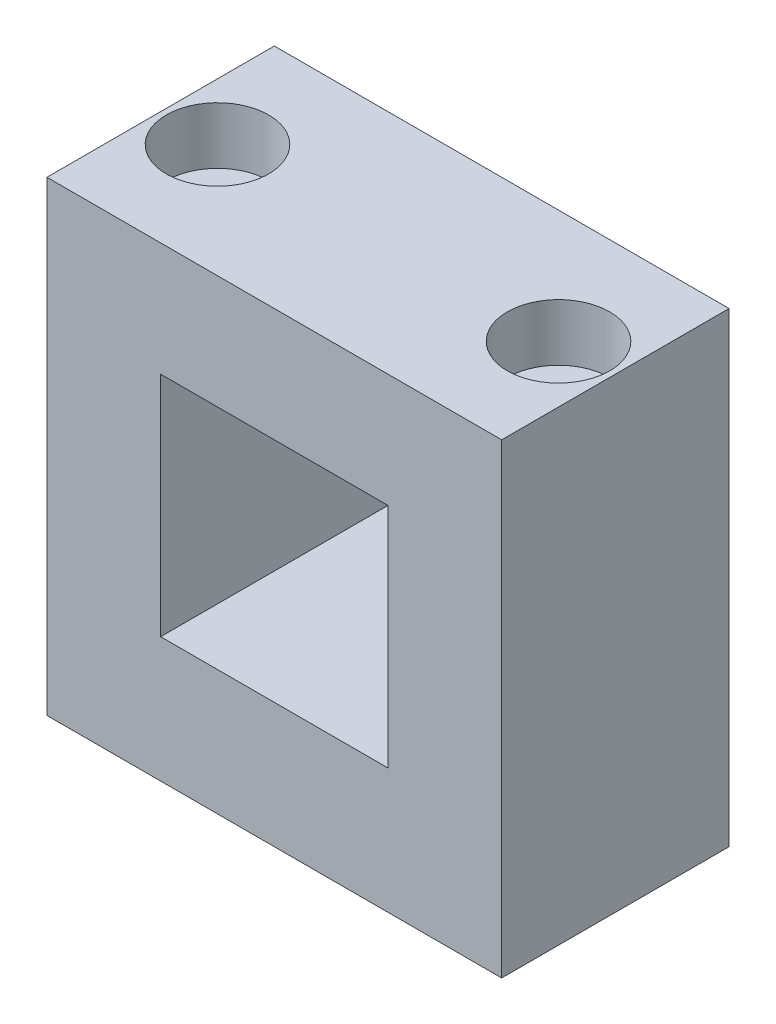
from build123d import *

# Parameters (mm, degrees)
SKETCH1_W           = 50.8
SKETCH1_H           = 52.07
SKETCH1_W_2         = 25.4
SKETCH1_H_2         = 25.4
BOSS_EXTRUDE1_DEPTH = 12.7
SKETCH2_R           = 3.175
CUT_EXTRUDE1_DEPTH  = 52.07
SKETCH3_R           = 5.715
CUT_EXTRUDE2_DEPTH  = 6.35


with BuildPart() as part:
    # Sketch1 → Boss-Extrude1 (new, symmetric)
    with BuildSketch(Plane.XY):
        Rectangle(SKETCH1_W, SKETCH1_H)
        with Locations((0, 0.635)):
            Rectangle(SKETCH1_W_2, SKETCH1_H_2, mode=Mode.SUBTRACT)
    extrude(amount=BOSS_EXTRUDE1_DEPTH, both=True)

    # Sketch2 → Cut-Extrude1 (cut)
    with BuildSketch(Plane(origin=(0, 26.035, 0), x_dir=(1, 0, 0), z_dir=(0, 1, 0))):
        with Locations(Location((-19.05, 0, 0), (0, 0, 180))):
            Circle(SKETCH2_R)
        with Locations(Location((19.05, 0, 0), (0, 0, 180))):
            Circle(SKETCH2_R)
    extrude(amount=-CUT_EXTRUDE1_DEPTH, mode=Mode.SUBTRACT)

    # Sketch3 → Cut-Extrude2 (cut)
    with BuildSketch(Plane(origin=(0, 26.035, 0), x_dir=(1, 0, 0), z_dir=(0, 1, 0))):
        with Locations(Location((-19.05, 0, 0), (0, 0, 180))):
            Circle(SKETCH3_R)
        with Locations(Location((19.05, 0, 0), (0, 0, 180))):
            Circle(SKETCH3_R)
    extrude(amount=-CUT_EXTRUDE2_DEPTH, mode=Mode.SUBTRACT)


solid = part.part
